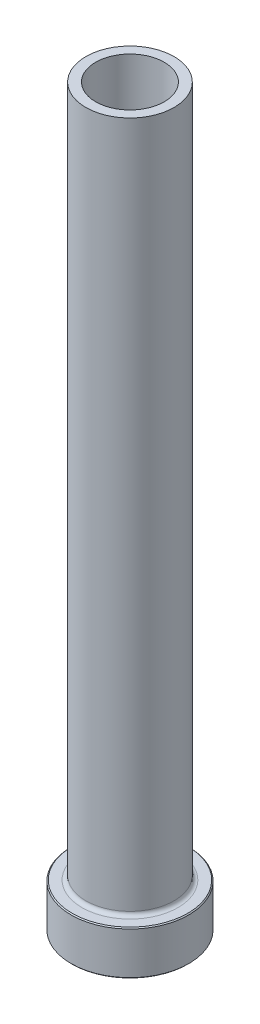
from build123d import *

# Parameters (mm, degrees)
FILLET1_R     = 0.8
CHAMFER1_SIZE = 0.2
CHAMFER3_SIZE = 0.5


with BuildPart() as part:
    # Sketch1 → Revolve1 (revolve)
    with BuildSketch(Plane.XY, mode=Mode.PRIVATE) as revolve1_sk:
        Polygon((-7, 150), (-9, 150), (-9, 9), (-12, 9), (-12, 0), (-7.25, 0), (-7.25, 83), (-7, 95), align=None)
    revolve(revolve1_sk.sketch.rotate(Axis((0, 92.187680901, 0), (0, -1, 0)), 270), axis=Axis((0, 92.187680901, 0), (0, -1, 0)))

    # Fillet1
    fillet1_edges = [part.edges().sort_by_distance(p)[0] for p in [
        (0, 9, -9),
    ]]
    fillet(fillet1_edges, radius=FILLET1_R)

    # Chamfer1
    chamfer1_edges = [part.edges().sort_by_distance(p)[0] for p in [
        (0, 0, -12),
        (0, 9, -12),
    ]]
    chamfer(chamfer1_edges, length=CHAMFER1_SIZE)

    # Chamfer3
    chamfer3_edges = [part.edges().sort_by_distance(p)[0] for p in [
        (0, 0, -7.25),
    ]]
    chamfer(chamfer3_edges, length=CHAMFER3_SIZE)


solid = part.part
